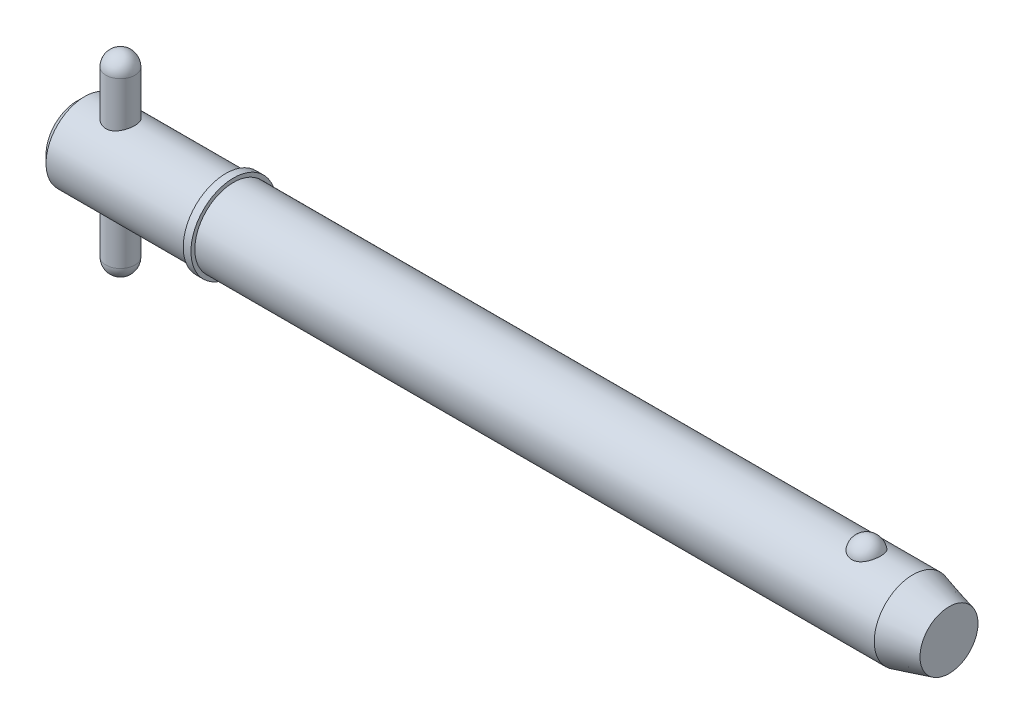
ISO-10303-21;
HEADER;
FILE_DESCRIPTION(('STEP AP214'),'2;1');
FILE_NAME('part.step','',(''),(''),'','','');
FILE_SCHEMA(('AUTOMOTIVE_DESIGN { 1 0 10303 214 1 1 1 1 }'));
ENDSEC;
DATA;
#1=APPLICATION_CONTEXT('core data for automotive mechanical design processes');
#2=APPLICATION_PROTOCOL_DEFINITION('international standard','automotive_design',2000,#1);
#3=PRODUCT_CONTEXT('',#1,'mechanical');
#4=PRODUCT('Part','Part','',(#3));
#5=PRODUCT_RELATED_PRODUCT_CATEGORY('part','',(#4));
#6=PRODUCT_DEFINITION_FORMATION('','',#4);
#7=PRODUCT_DEFINITION_CONTEXT('part definition',#1,'design');
#8=PRODUCT_DEFINITION('design','',#6,#7);
#9=PRODUCT_DEFINITION_SHAPE('','',#8);
#10=(LENGTH_UNIT() NAMED_UNIT(*) SI_UNIT(.MILLI.,.METRE.));
#11=(NAMED_UNIT(*) PLANE_ANGLE_UNIT() SI_UNIT($,.RADIAN.));
#12=(NAMED_UNIT(*) SI_UNIT($,.STERADIAN.) SOLID_ANGLE_UNIT());
#13=UNCERTAINTY_MEASURE_WITH_UNIT(LENGTH_MEASURE(1.E-05),#10,'distance_accuracy_value','');
#14=(GEOMETRIC_REPRESENTATION_CONTEXT(3) GLOBAL_UNCERTAINTY_ASSIGNED_CONTEXT((#13)) GLOBAL_UNIT_ASSIGNED_CONTEXT((#10,
#11,#12)) REPRESENTATION_CONTEXT('',''));
#15=CARTESIAN_POINT('',(0.,0.,0.));
#16=DIRECTION('',(0.,0.,1.));
#17=DIRECTION('',(1.,0.,0.));
#18=AXIS2_PLACEMENT_3D('',#15,#16,#17);
#19=CARTESIAN_POINT('',(7.14,15.875,0.));
#20=DIRECTION('',(0.,-1.,0.));
#21=DIRECTION('',(0.,0.,-1.));
#22=AXIS2_PLACEMENT_3D('',#19,#20,#21);
#23=CYLINDRICAL_SURFACE('',#22,2.38);
#24=CARTESIAN_POINT('',(7.14,-13.495,0.));
#25=DIRECTION('',(0.,-1.,0.));
#26=DIRECTION('',(0.,0.,-1.));
#27=AXIS2_PLACEMENT_3D('',#24,#25,#26);
#28=CIRCLE('',#27,2.38);
#29=CARTESIAN_POINT('',(7.14,-13.495,-2.38));
#30=VERTEX_POINT('',#29);
#31=EDGE_CURVE('P0_E10',#30,#30,#28,.F.);
#32=ORIENTED_EDGE('',*,*,#31,.T.);
#33=EDGE_LOOP('',(#32));
#34=FACE_BOUND('',#33,.T.);
#35=CARTESIAN_POINT('',(7.14,13.495,0.));
#36=DIRECTION('',(0.,-1.,0.));
#37=DIRECTION('',(0.,0.,-1.));
#38=AXIS2_PLACEMENT_3D('',#35,#36,#37);
#39=CIRCLE('',#38,2.38);
#40=CARTESIAN_POINT('',(7.14,13.495,-2.38));
#41=VERTEX_POINT('',#40);
#42=EDGE_CURVE('P0_E21',#41,#41,#39,.T.);
#43=ORIENTED_EDGE('',*,*,#42,.T.);
#44=EDGE_LOOP('',(#43));
#45=FACE_BOUND('',#44,.T.);
#46=ADVANCED_FACE('P0_F14',(#34,#45),#23,.T.);
#47=CARTESIAN_POINT('',(7.14,-13.495,0.));
#48=DIRECTION('',(0.,0.,1.));
#49=DIRECTION('',(1.,0.,0.));
#50=AXIS2_PLACEMENT_3D('',#47,#48,#49);
#51=SPHERICAL_SURFACE('',#50,2.38);
#52=CARTESIAN_POINT('',(7.14,-13.495,0.));
#53=DIRECTION('',(0.,-1.,0.));
#54=DIRECTION('',(0.,0.,-1.));
#55=AXIS2_PLACEMENT_3D('',#52,#53,#54);
#56=SPHERICAL_SURFACE('',#55,2.38);
#57=ORIENTED_EDGE('',*,*,#31,.F.);
#58=EDGE_LOOP('',(#57));
#59=FACE_BOUND('',#58,.T.);
#60=ADVANCED_FACE('P0_F29',(#59),#56,.T.);
#61=CARTESIAN_POINT('',(7.14,13.495,0.));
#62=DIRECTION('',(0.,0.,1.));
#63=DIRECTION('',(1.,0.,0.));
#64=AXIS2_PLACEMENT_3D('',#61,#62,#63);
#65=SPHERICAL_SURFACE('',#64,2.38);
#66=CARTESIAN_POINT('',(7.14,13.495,0.));
#67=DIRECTION('',(0.,-1.,0.));
#68=DIRECTION('',(0.,0.,-1.));
#69=AXIS2_PLACEMENT_3D('',#66,#67,#68);
#70=SPHERICAL_SURFACE('',#69,2.38);
#71=ORIENTED_EDGE('',*,*,#42,.F.);
#72=EDGE_LOOP('',(#71));
#73=FACE_BOUND('',#72,.T.);
#74=ADVANCED_FACE('P0_F16',(#73),#70,.T.);
#75=CLOSED_SHELL('',(#46,#60,#74));
#76=MANIFOLD_SOLID_BREP('P0_B1',#75);
#77=CARTESIAN_POINT('',(0.,0.,0.));
#78=DIRECTION('',(1.,0.,0.));
#79=DIRECTION('',(0.,0.,-1.));
#80=AXIS2_PLACEMENT_3D('',#77,#78,#79);
#81=CYLINDRICAL_SURFACE('',#80,6.35);
#82=CARTESIAN_POINT('',(137.255369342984,0.,0.));
#83=DIRECTION('',(1.,0.,0.));
#84=DIRECTION('',(0.,0.,-1.));
#85=AXIS2_PLACEMENT_3D('',#82,#83,#84);
#86=CIRCLE('',#85,6.35);
#87=CARTESIAN_POINT('',(137.255369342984,0.,-6.35));
#88=VERTEX_POINT('',#87);
#89=EDGE_CURVE('P1_E81',#88,#88,#86,.T.);
#90=ORIENTED_EDGE('',*,*,#89,.F.);
#91=EDGE_LOOP('',(#90));
#92=FACE_BOUND('',#91,.T.);
#93=CARTESIAN_POINT('',(25.7,0.,0.));
#94=DIRECTION('',(1.,0.,0.));
#95=DIRECTION('',(0.,0.,-1.));
#96=AXIS2_PLACEMENT_3D('',#93,#94,#95);
#97=CIRCLE('',#96,6.35);
#98=CARTESIAN_POINT('',(25.7,0.,-6.35));
#99=VERTEX_POINT('',#98);
#100=EDGE_CURVE('P1_E85',#99,#99,#97,.T.);
#101=ORIENTED_EDGE('',*,*,#100,.T.);
#102=EDGE_LOOP('',(#101));
#103=FACE_BOUND('',#102,.T.);
#104=CARTESIAN_POINT('',(129.630021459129,5.87502187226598,2.40969251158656));
#105=CARTESIAN_POINT('',(129.505030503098,5.87501645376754,2.40969773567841));
#106=CARTESIAN_POINT('',(129.380080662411,5.87916061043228,2.3996729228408));
#107=CARTESIAN_POINT('',(129.133909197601,5.89523112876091,2.35991730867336));
#108=CARTESIAN_POINT('',(129.012686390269,5.90715499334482,2.33019283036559));
#109=CARTESIAN_POINT('',(128.777517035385,5.9373956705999,2.25201402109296));
#110=CARTESIAN_POINT('',(128.663560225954,5.95570321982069,2.20358681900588));
#111=CARTESIAN_POINT('',(128.44557352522,5.99672067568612,2.08937987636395));
#112=CARTESIAN_POINT('',(128.341545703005,6.01943149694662,2.0235965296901));
#113=CARTESIAN_POINT('',(128.142943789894,6.06760647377,1.87428969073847));
#114=CARTESIAN_POINT('',(128.048726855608,6.0931309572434,1.79031110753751));
#115=CARTESIAN_POINT('',(127.875255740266,6.14375873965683,1.60800178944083));
#116=CARTESIAN_POINT('',(127.796004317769,6.16886196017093,1.50966841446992));
#117=CARTESIAN_POINT('',(127.650845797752,6.2172460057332,1.29645884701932));
#118=CARTESIAN_POINT('',(127.585688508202,6.24039621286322,1.18104158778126));
#119=CARTESIAN_POINT('',(127.474703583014,6.28117277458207,0.940351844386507));
#120=CARTESIAN_POINT('',(127.428877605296,6.29879865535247,0.815078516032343));
#121=CARTESIAN_POINT('',(127.357023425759,6.32692073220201,0.556494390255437));
#122=CARTESIAN_POINT('',(127.331249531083,6.33732517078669,0.423102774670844));
#123=CARTESIAN_POINT('',(127.300988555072,6.34957673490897,0.15354272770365));
#124=CARTESIAN_POINT('',(127.296500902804,6.35142408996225,0.0173743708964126));
#125=CARTESIAN_POINT('',(127.308865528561,6.34638925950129,-0.253036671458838));
#126=CARTESIAN_POINT('',(127.325594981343,6.33955731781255,-0.38728593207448));
#127=CARTESIAN_POINT('',(127.379843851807,6.31794129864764,-0.650851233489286));
#128=CARTESIAN_POINT('',(127.417363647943,6.30315707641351,-0.780167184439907));
#129=CARTESIAN_POINT('',(127.512500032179,6.26711642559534,-1.03041949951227));
#130=CARTESIAN_POINT('',(127.570143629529,6.24585130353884,-1.1513443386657));
#131=CARTESIAN_POINT('',(127.704352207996,6.19905619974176,-1.38129800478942));
#132=CARTESIAN_POINT('',(127.780918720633,6.17352587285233,-1.49032586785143));
#133=CARTESIAN_POINT('',(127.951753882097,6.12080227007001,-1.69393164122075));
#134=CARTESIAN_POINT('',(128.046100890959,6.09360200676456,-1.78844209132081));
#135=CARTESIAN_POINT('',(128.250119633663,6.0407043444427,-1.95970536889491));
#136=CARTESIAN_POINT('',(128.359790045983,6.01500681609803,-2.03645972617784));
#137=CARTESIAN_POINT('',(128.589187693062,5.96867714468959,-2.16845644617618));
#138=CARTESIAN_POINT('',(128.708652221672,5.94794910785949,-2.22412062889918));
#139=CARTESIAN_POINT('',(128.956218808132,5.91340580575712,-2.31440992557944));
#140=CARTESIAN_POINT('',(129.084317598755,5.8995879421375,-2.34904294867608));
#141=CARTESIAN_POINT('',(129.338582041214,5.88111049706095,-2.39491590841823));
#142=CARTESIAN_POINT('',(129.464520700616,5.876025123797,-2.40724512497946));
#143=CARTESIAN_POINT('',(129.716786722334,5.87428980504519,-2.41147867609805));
#144=CARTESIAN_POINT('',(129.843114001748,5.87763817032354,-2.4033871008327));
#145=CARTESIAN_POINT('',(130.088417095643,5.89212921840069,-2.36762715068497));
#146=CARTESIAN_POINT('',(130.207499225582,5.90302431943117,-2.34058030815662));
#147=CARTESIAN_POINT('',(130.43924472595,5.93113752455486,-2.26839066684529));
#148=CARTESIAN_POINT('',(130.551907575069,5.94835614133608,-2.22324640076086));
#149=CARTESIAN_POINT('',(130.770400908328,5.98773016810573,-2.1149380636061));
#150=CARTESIAN_POINT('',(130.876028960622,6.00998499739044,-2.05140269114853));
#151=CARTESIAN_POINT('',(131.075300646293,6.0569014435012,-1.9084270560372));
#152=CARTESIAN_POINT('',(131.168941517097,6.08156361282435,-1.82898313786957));
#153=CARTESIAN_POINT('',(131.346675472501,6.13211715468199,-1.65182429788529));
#154=CARTESIAN_POINT('',(131.430055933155,6.15800825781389,-1.55339381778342));
#155=CARTESIAN_POINT('',(131.579790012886,6.2071283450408,-1.34374214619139));
#156=CARTESIAN_POINT('',(131.646140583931,6.23035685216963,-1.23251867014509));
#157=CARTESIAN_POINT('',(131.762345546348,6.27251177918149,-0.99644720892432));
#158=CARTESIAN_POINT('',(131.811607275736,6.29127762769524,-0.871278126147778));
#159=CARTESIAN_POINT('',(131.889614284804,6.3215862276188,-0.613870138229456));
#160=CARTESIAN_POINT('',(131.918359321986,6.33312889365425,-0.481631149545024));
#161=CARTESIAN_POINT('',(131.95477058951,6.34782349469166,-0.213672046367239));
#162=CARTESIAN_POINT('',(131.962413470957,6.35096613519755,-0.0779482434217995));
#163=CARTESIAN_POINT('',(131.956395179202,6.34851322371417,0.192943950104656));
#164=CARTESIAN_POINT('',(131.942734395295,6.3429178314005,0.328112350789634));
#165=CARTESIAN_POINT('',(131.89450361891,6.32360512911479,0.593406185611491));
#166=CARTESIAN_POINT('',(131.860031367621,6.30992579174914,0.723552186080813));
#167=CARTESIAN_POINT('',(131.770953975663,6.27586325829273,0.975834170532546));
#168=CARTESIAN_POINT('',(131.71634761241,6.25547965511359,1.09796966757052));
#169=CARTESIAN_POINT('',(131.58775879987,6.20998183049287,1.33148921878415));
#170=CARTESIAN_POINT('',(131.513674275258,6.18484288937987,1.44281227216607));
#171=CARTESIAN_POINT('',(131.347820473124,6.13258735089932,1.65087683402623));
#172=CARTESIAN_POINT('',(131.256051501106,6.10547078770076,1.74761859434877));
#173=CARTESIAN_POINT('',(131.057183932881,6.05235879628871,1.92350926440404));
#174=CARTESIAN_POINT('',(130.950133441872,6.02636017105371,2.00271146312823));
#175=CARTESIAN_POINT('',(130.723138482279,5.97843747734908,2.14154159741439));
#176=CARTESIAN_POINT('',(130.603191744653,5.95651412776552,2.2011660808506));
#177=CARTESIAN_POINT('',(130.344523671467,5.91812106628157,2.30250570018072));
#178=CARTESIAN_POINT('',(130.20506980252,5.90217533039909,2.34256795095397));
#179=CARTESIAN_POINT('',(129.920397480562,5.88063128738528,2.39615214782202));
#180=CARTESIAN_POINT('',(129.77518174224,5.87502816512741,2.40968644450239));
#181=CARTESIAN_POINT('',(129.630021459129,5.87502187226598,2.40969251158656));
#182=B_SPLINE_CURVE_WITH_KNOTS('',3,(#104,#105,#106,#107,#108,#109,#110,#111,#112,#113,#114,
#115,#116,#117,#118,#119,#120,#121,#122,#123,#124,#125,#126,#127,#128,#129,#130,#131,#132,#133,
#134,#135,#136,#137,#138,#139,#140,#141,#142,#143,#144,#145,#146,#147,#148,#149,#150,#151,#152,
#153,#154,#155,#156,#157,#158,#159,#160,#161,#162,#163,#164,#165,#166,#167,#168,#169,#170,#171,
#172,#173,#174,#175,#176,#177,#178,#179,#180,#181),.UNSPECIFIED.,.T.,.F.,(4,2,2,2,2,2,2,2,2,2,2,
2,2,2,2,2,2,2,2,2,2,2,2,2,2,2,2,2,2,2,2,2,2,2,2,2,2,2,4),(0.,0.374440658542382,
0.748761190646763,1.12254078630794,1.49639810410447,1.88098871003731,2.2656501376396,
2.66741104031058,3.06920639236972,3.47601794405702,3.88281858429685,4.28727498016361,
4.69173873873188,5.09674745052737,5.50178895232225,5.90865911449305,6.31549420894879,
6.71369855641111,7.11175305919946,7.48978077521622,7.8677327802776,8.23383886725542,
8.5999746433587,8.97409044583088,9.34829231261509,9.74122667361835,10.1342313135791,
10.539752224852,10.945277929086,11.3512521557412,11.7572189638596,12.1612938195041,
12.5653932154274,12.9716540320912,13.37790783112,13.782909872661,14.1879832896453,
14.6230486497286,15.0579114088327),.UNSPECIFIED.);
#183=CARTESIAN_POINT('',(129.630021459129,5.87502187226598,2.40969251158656));
#184=VERTEX_POINT('',#183);
#185=EDGE_CURVE('P1_E35',#184,#184,#182,.T.);
#186=ORIENTED_EDGE('',*,*,#185,.T.);
#187=EDGE_LOOP('',(#186));
#188=FACE_BOUND('',#187,.T.);
#189=ADVANCED_FACE('P1_F13',(#92,#103,#188),#81,.T.);
#190=CARTESIAN_POINT('',(0.,0.,0.));
#191=DIRECTION('',(-1.,0.,0.));
#192=DIRECTION('',(0.,0.,1.));
#193=AXIS2_PLACEMENT_3D('',#190,#191,#192);
#194=PLANE('',#193);
#195=CARTESIAN_POINT('',(0.,0.,0.));
#196=DIRECTION('',(1.,0.,0.));
#197=DIRECTION('',(0.,0.,-1.));
#198=AXIS2_PLACEMENT_3D('',#195,#196,#197);
#199=CIRCLE('',#198,5.08);
#200=CARTESIAN_POINT('',(0.,0.,-5.08));
#201=VERTEX_POINT('',#200);
#202=EDGE_CURVE('P1_E9',#201,#201,#199,.T.);
#203=ORIENTED_EDGE('',*,*,#202,.F.);
#204=EDGE_LOOP('',(#203));
#205=FACE_BOUND('',#204,.T.);
#206=ADVANCED_FACE('P1_F15',(#205),#194,.T.);
#207=CARTESIAN_POINT('',(1.27,0.,0.));
#208=DIRECTION('',(1.,0.,0.));
#209=DIRECTION('',(0.,0.,-1.));
#210=AXIS2_PLACEMENT_3D('',#207,#208,#209);
#211=CONICAL_SURFACE('',#210,6.35,0.78539816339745);
#212=ORIENTED_EDGE('',*,*,#202,.T.);
#213=EDGE_LOOP('',(#212));
#214=FACE_BOUND('',#213,.T.);
#215=CARTESIAN_POINT('',(1.27,0.,0.));
#216=DIRECTION('',(1.,0.,0.));
#217=DIRECTION('',(0.,0.,-1.));
#218=AXIS2_PLACEMENT_3D('',#215,#216,#217);
#219=CIRCLE('',#218,6.35);
#220=CARTESIAN_POINT('',(1.27,0.,-6.35));
#221=VERTEX_POINT('',#220);
#222=EDGE_CURVE('P1_E26',#221,#221,#219,.T.);
#223=ORIENTED_EDGE('',*,*,#222,.F.);
#224=EDGE_LOOP('',(#223));
#225=FACE_BOUND('',#224,.T.);
#226=ADVANCED_FACE('P1_F77',(#214,#225),#211,.T.);
#227=CARTESIAN_POINT('',(0.,0.,0.));
#228=DIRECTION('',(1.,0.,0.));
#229=DIRECTION('',(0.,0.,-1.));
#230=AXIS2_PLACEMENT_3D('',#227,#228,#229);
#231=CYLINDRICAL_SURFACE('',#230,6.35);
#232=CARTESIAN_POINT('',(7.14,-5.88711304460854,2.38));
#233=CARTESIAN_POINT('',(7.01146258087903,-5.88710856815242,2.38000480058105));
#234=CARTESIAN_POINT('',(6.88295682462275,-5.89136840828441,2.36955244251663));
#235=CARTESIAN_POINT('',(6.62981934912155,-5.90782785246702,2.32820953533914));
#236=CARTESIAN_POINT('',(6.50518751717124,-5.92002722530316,2.29731958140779));
#237=CARTESIAN_POINT('',(6.26352403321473,-5.95079384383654,2.21639366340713));
#238=CARTESIAN_POINT('',(6.14647496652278,-5.96934583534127,2.16640353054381));
#239=CARTESIAN_POINT('',(5.92237941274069,-6.01070278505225,2.04885862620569));
#240=CARTESIAN_POINT('',(5.81533593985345,-6.03350901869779,1.98129858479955));
#241=CARTESIAN_POINT('',(5.60897525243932,-6.08207341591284,1.82693902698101));
#242=CARTESIAN_POINT('',(5.51022503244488,-6.10791836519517,1.73940861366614));
#243=CARTESIAN_POINT('',(5.32840561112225,-6.15892405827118,1.54914379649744));
#244=CARTESIAN_POINT('',(5.24533975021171,-6.1840846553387,1.44640616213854));
#245=CARTESIAN_POINT('',(5.09451639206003,-6.23191821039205,1.22434014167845));
#246=CARTESIAN_POINT('',(5.02737511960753,-6.25447755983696,1.10456656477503));
#247=CARTESIAN_POINT('',(4.91443001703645,-6.2935236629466,0.854429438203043));
#248=CARTESIAN_POINT('',(4.86861879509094,-6.31001251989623,0.724069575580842));
#249=CARTESIAN_POINT('',(4.80162253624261,-6.33444370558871,0.46242122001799));
#250=CARTESIAN_POINT('',(4.77946137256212,-6.34272370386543,0.331414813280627));
#251=CARTESIAN_POINT('',(4.75726677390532,-6.35101600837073,0.0672982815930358));
#252=CARTESIAN_POINT('',(4.75722615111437,-6.35103100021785,-0.0658111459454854));
#253=CARTESIAN_POINT('',(4.77870510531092,-6.3430064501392,-0.323358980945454));
#254=CARTESIAN_POINT('',(4.79915922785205,-6.33536494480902,-0.447900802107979));
#255=CARTESIAN_POINT('',(4.85925493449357,-6.31340794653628,-0.69163609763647));
#256=CARTESIAN_POINT('',(4.89889787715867,-6.29909198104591,-0.810829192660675));
#257=CARTESIAN_POINT('',(4.9967414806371,-6.26494471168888,-1.04254212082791));
#258=CARTESIAN_POINT('',(5.05520370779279,-6.24503620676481,-1.1549396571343));
#259=CARTESIAN_POINT('',(5.1887948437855,-6.20171869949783,-1.3686079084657));
#260=CARTESIAN_POINT('',(5.26392912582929,-6.17830856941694,-1.46987502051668));
#261=CARTESIAN_POINT('',(5.43386591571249,-6.12878580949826,-1.66468415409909));
#262=CARTESIAN_POINT('',(5.52956139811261,-6.10259519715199,-1.75742857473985));
#263=CARTESIAN_POINT('',(5.73530435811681,-6.05155777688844,-1.92585331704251));
#264=CARTESIAN_POINT('',(5.84535542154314,-6.02671130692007,-2.00152936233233));
#265=CARTESIAN_POINT('',(6.07982989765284,-5.98068420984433,-2.13519109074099));
#266=CARTESIAN_POINT('',(6.20451768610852,-5.95959698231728,-2.19274775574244));
#267=CARTESIAN_POINT('',(6.4628145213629,-5.92455622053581,-2.28574558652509));
#268=CARTESIAN_POINT('',(6.59641856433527,-5.91059872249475,-2.32119904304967));
#269=CARTESIAN_POINT('',(6.86087441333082,-5.8923327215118,-2.36717069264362));
#270=CARTESIAN_POINT('',(6.99147192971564,-5.8875347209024,-2.37895573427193));
#271=CARTESIAN_POINT('',(7.25283805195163,-5.88674545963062,-2.38091046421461));
#272=CARTESIAN_POINT('',(7.38360660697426,-5.89075200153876,-2.37108554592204));
#273=CARTESIAN_POINT('',(7.63510696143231,-5.90662331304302,-2.33124781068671));
#274=CARTESIAN_POINT('',(7.75602069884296,-5.91810660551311,-2.30221396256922));
#275=CARTESIAN_POINT('',(7.99120505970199,-5.94718527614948,-2.22601401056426));
#276=CARTESIAN_POINT('',(8.10547431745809,-5.96478190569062,-2.17884419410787));
#277=CARTESIAN_POINT('',(8.32888632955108,-6.00491533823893,-2.06572311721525));
#278=CARTESIAN_POINT('',(8.43767672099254,-6.02761250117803,-1.99913452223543));
#279=CARTESIAN_POINT('',(8.6429894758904,-6.07511988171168,-1.84974438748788));
#280=CARTESIAN_POINT('',(8.73950733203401,-6.09993087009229,-1.76693691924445));
#281=CARTESIAN_POINT('',(8.9238741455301,-6.1507686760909,-1.58125563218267));
#282=CARTESIAN_POINT('',(9.01078732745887,-6.17677301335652,-1.47744327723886));
#283=CARTESIAN_POINT('',(9.16607127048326,-6.22556172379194,-1.25606967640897));
#284=CARTESIAN_POINT('',(9.23444197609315,-6.24834608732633,-1.13850838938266));
#285=CARTESIAN_POINT('',(9.3502493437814,-6.28811144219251,-0.893050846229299));
#286=CARTESIAN_POINT('',(9.39775808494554,-6.30511236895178,-0.765192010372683));
#287=CARTESIAN_POINT('',(9.47032640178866,-6.33145833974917,-0.502514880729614));
#288=CARTESIAN_POINT('',(9.49539651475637,-6.34080697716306,-0.367699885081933));
#289=CARTESIAN_POINT('',(9.52124059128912,-6.35045496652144,-0.103396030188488));
#290=CARTESIAN_POINT('',(9.52334421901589,-6.35124952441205,0.025945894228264));
#291=CARTESIAN_POINT('',(9.50661518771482,-6.34499064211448,0.283061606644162));
#292=CARTESIAN_POINT('',(9.48778504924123,-6.33793814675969,0.410835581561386));
#293=CARTESIAN_POINT('',(9.43065630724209,-6.31700307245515,0.658028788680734));
#294=CARTESIAN_POINT('',(9.39284291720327,-6.30329098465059,0.7775756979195));
#295=CARTESIAN_POINT('',(9.29930406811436,-6.27046903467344,1.00863789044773));
#296=CARTESIAN_POINT('',(9.2435752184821,-6.25135815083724,1.12015164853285));
#297=CARTESIAN_POINT('',(9.11312349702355,-6.20865254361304,1.33711407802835));
#298=CARTESIAN_POINT('',(9.03770094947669,-6.18490316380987,1.44211105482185));
#299=CARTESIAN_POINT('',(8.87110640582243,-6.13583718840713,1.63836897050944));
#300=CARTESIAN_POINT('',(8.77992879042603,-6.11052003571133,1.72962498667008));
#301=CARTESIAN_POINT('',(8.57869799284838,-6.05953829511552,1.90076098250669));
#302=CARTESIAN_POINT('',(8.46790320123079,-6.03392573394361,1.97978778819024));
#303=CARTESIAN_POINT('',(8.23379693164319,-5.98676607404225,2.11813466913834));
#304=CARTESIAN_POINT('',(8.11048418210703,-5.9652193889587,2.17745273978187));
#305=CARTESIAN_POINT('',(7.84900037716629,-5.92818393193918,2.27641807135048));
#306=CARTESIAN_POINT('',(7.71041678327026,-5.91299857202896,2.31510015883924));
#307=CARTESIAN_POINT('',(7.42787316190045,-5.89246887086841,2.36688002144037));
#308=CARTESIAN_POINT('',(7.28391673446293,-5.88711805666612,2.37999462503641));
#309=CARTESIAN_POINT('',(7.14,-5.88711304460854,2.38));
#310=B_SPLINE_CURVE_WITH_KNOTS('',3,(#232,#233,#234,#235,#236,#237,#238,#239,#240,#241,#242,
#243,#244,#245,#246,#247,#248,#249,#250,#251,#252,#253,#254,#255,#256,#257,#258,#259,#260,#261,
#262,#263,#264,#265,#266,#267,#268,#269,#270,#271,#272,#273,#274,#275,#276,#277,#278,#279,#280,
#281,#282,#283,#284,#285,#286,#287,#288,#289,#290,#291,#292,#293,#294,#295,#296,#297,#298,#299,
#300,#301,#302,#303,#304,#305,#306,#307,#308,#309),.UNSPECIFIED.,.T.,.F.,(4,2,2,2,2,2,2,2,2,2,2,
2,2,2,2,2,2,2,2,2,2,2,2,2,2,2,2,2,2,2,2,2,2,2,2,2,2,2,4),(0.,0.385076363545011,
0.770141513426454,1.15428843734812,1.53855071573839,1.94016118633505,2.3418570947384,
2.75720522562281,3.1724093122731,3.569721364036,3.96690431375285,4.34445758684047,
4.72203759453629,5.10511017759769,5.48830640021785,5.89390240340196,6.29959991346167,
6.71428455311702,7.12873839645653,7.52034494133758,7.91185376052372,8.28480528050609,
8.65783318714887,9.0448340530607,9.43197664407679,9.84363087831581,10.2552863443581,
10.6655081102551,11.0755371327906,11.4616919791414,11.847800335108,12.224507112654,
12.6012852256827,12.9938941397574,13.386643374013,13.8000944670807,14.2135876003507,
14.6450218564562,15.0761720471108),.UNSPECIFIED.);
#311=CARTESIAN_POINT('',(7.14,-5.88711304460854,2.38));
#312=VERTEX_POINT('',#311);
#313=EDGE_CURVE('P1_E17',#312,#312,#310,.T.);
#314=ORIENTED_EDGE('',*,*,#313,.F.);
#315=EDGE_LOOP('',(#314));
#316=FACE_BOUND('',#315,.T.);
#317=CARTESIAN_POINT('',(7.14,5.88711304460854,2.38));
#318=CARTESIAN_POINT('',(7.26853741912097,5.88710856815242,2.38000480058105));
#319=CARTESIAN_POINT('',(7.39704317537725,5.89136840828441,2.36955244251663));
#320=CARTESIAN_POINT('',(7.65018065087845,5.90782785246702,2.32820953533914));
#321=CARTESIAN_POINT('',(7.77481248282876,5.92002722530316,2.29731958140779));
#322=CARTESIAN_POINT('',(8.01647596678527,5.95079384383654,2.21639366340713));
#323=CARTESIAN_POINT('',(8.13352503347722,5.96934583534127,2.16640353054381));
#324=CARTESIAN_POINT('',(8.35762058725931,6.01070278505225,2.04885862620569));
#325=CARTESIAN_POINT('',(8.46466406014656,6.03350901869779,1.98129858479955));
#326=CARTESIAN_POINT('',(8.67102474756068,6.08207341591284,1.82693902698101));
#327=CARTESIAN_POINT('',(8.76977496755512,6.10791836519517,1.73940861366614));
#328=CARTESIAN_POINT('',(8.95159438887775,6.15892405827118,1.54914379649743));
#329=CARTESIAN_POINT('',(9.03466024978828,6.1840846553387,1.44640616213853));
#330=CARTESIAN_POINT('',(9.18548360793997,6.23191821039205,1.22434014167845));
#331=CARTESIAN_POINT('',(9.25262488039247,6.25447755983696,1.10456656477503));
#332=CARTESIAN_POINT('',(9.36556998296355,6.2935236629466,0.854429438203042));
#333=CARTESIAN_POINT('',(9.41138120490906,6.31001251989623,0.72406957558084));
#334=CARTESIAN_POINT('',(9.47837746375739,6.33444370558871,0.462421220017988));
#335=CARTESIAN_POINT('',(9.50053862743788,6.34272370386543,0.331414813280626));
#336=CARTESIAN_POINT('',(9.52273322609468,6.35101600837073,0.0672982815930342));
#337=CARTESIAN_POINT('',(9.52277384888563,6.35103100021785,-0.0658111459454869));
#338=CARTESIAN_POINT('',(9.50129489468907,6.3430064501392,-0.323358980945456));
#339=CARTESIAN_POINT('',(9.48084077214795,6.33536494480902,-0.447900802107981));
#340=CARTESIAN_POINT('',(9.42074506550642,6.31340794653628,-0.691636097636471));
#341=CARTESIAN_POINT('',(9.38110212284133,6.29909198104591,-0.810829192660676));
#342=CARTESIAN_POINT('',(9.2832585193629,6.26494471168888,-1.04254212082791));
#343=CARTESIAN_POINT('',(9.22479629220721,6.24503620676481,-1.1549396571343));
#344=CARTESIAN_POINT('',(9.0912051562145,6.20171869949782,-1.3686079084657));
#345=CARTESIAN_POINT('',(9.0160708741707,6.17830856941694,-1.46987502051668));
#346=CARTESIAN_POINT('',(8.84613408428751,6.12878580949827,-1.66468415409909));
#347=CARTESIAN_POINT('',(8.75043860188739,6.10259519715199,-1.75742857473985));
#348=CARTESIAN_POINT('',(8.54469564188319,6.05155777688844,-1.92585331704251));
#349=CARTESIAN_POINT('',(8.43464457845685,6.02671130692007,-2.00152936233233));
#350=CARTESIAN_POINT('',(8.20017010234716,5.98068420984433,-2.13519109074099));
#351=CARTESIAN_POINT('',(8.07548231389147,5.95959698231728,-2.19274775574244));
#352=CARTESIAN_POINT('',(7.8171854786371,5.9245562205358,-2.28574558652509));
#353=CARTESIAN_POINT('',(7.68358143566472,5.91059872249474,-2.32119904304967));
#354=CARTESIAN_POINT('',(7.41912558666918,5.8923327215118,-2.36717069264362));
#355=CARTESIAN_POINT('',(7.28852807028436,5.8875347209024,-2.37895573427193));
#356=CARTESIAN_POINT('',(7.02716194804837,5.88674545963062,-2.38091046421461));
#357=CARTESIAN_POINT('',(6.89639339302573,5.89075200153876,-2.37108554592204));
#358=CARTESIAN_POINT('',(6.64489303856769,5.90662331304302,-2.33124781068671));
#359=CARTESIAN_POINT('',(6.52397930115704,5.91810660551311,-2.30221396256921));
#360=CARTESIAN_POINT('',(6.288794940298,5.94718527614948,-2.22601401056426));
#361=CARTESIAN_POINT('',(6.17452568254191,5.96478190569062,-2.17884419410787));
#362=CARTESIAN_POINT('',(5.95111367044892,6.00491533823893,-2.06572311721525));
#363=CARTESIAN_POINT('',(5.84232327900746,6.02761250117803,-1.99913452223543));
#364=CARTESIAN_POINT('',(5.6370105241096,6.07511988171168,-1.84974438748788));
#365=CARTESIAN_POINT('',(5.54049266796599,6.09993087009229,-1.76693691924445));
#366=CARTESIAN_POINT('',(5.3561258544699,6.1507686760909,-1.58125563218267));
#367=CARTESIAN_POINT('',(5.26921267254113,6.17677301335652,-1.47744327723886));
#368=CARTESIAN_POINT('',(5.11392872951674,6.22556172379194,-1.25606967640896));
#369=CARTESIAN_POINT('',(5.04555802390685,6.24834608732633,-1.13850838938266));
#370=CARTESIAN_POINT('',(4.9297506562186,6.28811144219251,-0.893050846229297));
#371=CARTESIAN_POINT('',(4.88224191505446,6.30511236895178,-0.76519201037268));
#372=CARTESIAN_POINT('',(4.80967359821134,6.33145833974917,-0.502514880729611));
#373=CARTESIAN_POINT('',(4.78460348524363,6.34080697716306,-0.36769988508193));
#374=CARTESIAN_POINT('',(4.75875940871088,6.35045496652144,-0.103396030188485));
#375=CARTESIAN_POINT('',(4.75665578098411,6.35124952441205,0.025945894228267));
#376=CARTESIAN_POINT('',(4.77338481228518,6.34499064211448,0.283061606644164));
#377=CARTESIAN_POINT('',(4.79221495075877,6.33793814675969,0.410835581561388));
#378=CARTESIAN_POINT('',(4.84934369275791,6.31700307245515,0.658028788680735));
#379=CARTESIAN_POINT('',(4.88715708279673,6.30329098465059,0.777575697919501));
#380=CARTESIAN_POINT('',(4.98069593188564,6.27046903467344,1.00863789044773));
#381=CARTESIAN_POINT('',(5.0364247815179,6.25135815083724,1.12015164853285));
#382=CARTESIAN_POINT('',(5.16687650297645,6.20865254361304,1.33711407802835));
#383=CARTESIAN_POINT('',(5.24229905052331,6.18490316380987,1.44211105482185));
#384=CARTESIAN_POINT('',(5.40889359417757,6.13583718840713,1.63836897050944));
#385=CARTESIAN_POINT('',(5.50007120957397,6.11052003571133,1.72962498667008));
#386=CARTESIAN_POINT('',(5.70130200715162,6.05953829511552,1.90076098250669));
#387=CARTESIAN_POINT('',(5.81209679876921,6.03392573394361,1.97978778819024));
#388=CARTESIAN_POINT('',(6.04620306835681,5.98676607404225,2.11813466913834));
#389=CARTESIAN_POINT('',(6.16951581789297,5.9652193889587,2.17745273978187));
#390=CARTESIAN_POINT('',(6.43099962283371,5.92818393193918,2.27641807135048));
#391=CARTESIAN_POINT('',(6.56958321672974,5.91299857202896,2.31510015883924));
#392=CARTESIAN_POINT('',(6.85212683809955,5.89246887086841,2.36688002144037));
#393=CARTESIAN_POINT('',(6.99608326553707,5.88711805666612,2.37999462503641));
#394=CARTESIAN_POINT('',(7.14,5.88711304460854,2.38));
#395=B_SPLINE_CURVE_WITH_KNOTS('',3,(#317,#318,#319,#320,#321,#322,#323,#324,#325,#326,#327,
#328,#329,#330,#331,#332,#333,#334,#335,#336,#337,#338,#339,#340,#341,#342,#343,#344,#345,#346,
#347,#348,#349,#350,#351,#352,#353,#354,#355,#356,#357,#358,#359,#360,#361,#362,#363,#364,#365,
#366,#367,#368,#369,#370,#371,#372,#373,#374,#375,#376,#377,#378,#379,#380,#381,#382,#383,#384,
#385,#386,#387,#388,#389,#390,#391,#392,#393,#394),.UNSPECIFIED.,.T.,.F.,(4,2,2,2,2,2,2,2,2,2,2,
2,2,2,2,2,2,2,2,2,2,2,2,2,2,2,2,2,2,2,2,2,2,2,2,2,2,2,4),(0.,0.385076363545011,
0.770141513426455,1.15428843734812,1.53855071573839,1.94016118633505,2.3418570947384,
2.75720522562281,3.1724093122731,3.56972136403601,3.96690431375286,4.34445758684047,
4.72203759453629,5.10511017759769,5.48830640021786,5.89390240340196,6.29959991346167,
6.71428455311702,7.12873839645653,7.52034494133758,7.91185376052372,8.2848052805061,
8.65783318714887,9.0448340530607,9.43197664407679,9.84363087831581,10.2552863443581,
10.6655081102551,11.0755371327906,11.4616919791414,11.847800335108,12.2245071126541,
12.6012852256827,12.9938941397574,13.386643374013,13.8000944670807,14.2135876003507,
14.6450218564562,15.0761720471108),.UNSPECIFIED.);
#396=CARTESIAN_POINT('',(7.14,5.88711304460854,2.38));
#397=VERTEX_POINT('',#396);
#398=EDGE_CURVE('P1_E43',#397,#397,#395,.T.);
#399=ORIENTED_EDGE('',*,*,#398,.F.);
#400=EDGE_LOOP('',(#399));
#401=FACE_BOUND('',#400,.T.);
#402=ORIENTED_EDGE('',*,*,#222,.T.);
#403=EDGE_LOOP('',(#402));
#404=FACE_BOUND('',#403,.T.);
#405=CARTESIAN_POINT('',(24.43,0.,0.));
#406=DIRECTION('',(1.,0.,0.));
#407=DIRECTION('',(0.,0.,-1.));
#408=AXIS2_PLACEMENT_3D('',#405,#406,#407);
#409=CIRCLE('',#408,6.35);
#410=CARTESIAN_POINT('',(24.43,0.,-6.35));
#411=VERTEX_POINT('',#410);
#412=EDGE_CURVE('P1_E31',#411,#411,#409,.T.);
#413=ORIENTED_EDGE('',*,*,#412,.F.);
#414=EDGE_LOOP('',(#413));
#415=FACE_BOUND('',#414,.T.);
#416=ADVANCED_FACE('P1_F103',(#316,#401,#404,#415),#231,.T.);
#417=CARTESIAN_POINT('',(24.43,6.35,0.));
#418=DIRECTION('',(-1.,0.,0.));
#419=DIRECTION('',(0.,0.,1.));
#420=AXIS2_PLACEMENT_3D('',#417,#418,#419);
#421=PLANE('',#420);
#422=ORIENTED_EDGE('',*,*,#412,.T.);
#423=EDGE_LOOP('',(#422));
#424=FACE_BOUND('',#423,.T.);
#425=CARTESIAN_POINT('',(24.43,0.,0.));
#426=DIRECTION('',(1.,0.,0.));
#427=DIRECTION('',(0.,0.,-1.));
#428=AXIS2_PLACEMENT_3D('',#425,#426,#427);
#429=CIRCLE('',#428,6.985);
#430=CARTESIAN_POINT('',(24.43,0.,-6.985));
#431=VERTEX_POINT('',#430);
#432=EDGE_CURVE('P1_E91',#431,#431,#429,.T.);
#433=ORIENTED_EDGE('',*,*,#432,.F.);
#434=EDGE_LOOP('',(#433));
#435=FACE_BOUND('',#434,.T.);
#436=ADVANCED_FACE('P1_F100',(#424,#435),#421,.T.);
#437=CARTESIAN_POINT('',(0.,0.,0.));
#438=DIRECTION('',(1.,0.,0.));
#439=DIRECTION('',(0.,0.,-1.));
#440=AXIS2_PLACEMENT_3D('',#437,#438,#439);
#441=CYLINDRICAL_SURFACE('',#440,6.985);
#442=ORIENTED_EDGE('',*,*,#432,.T.);
#443=EDGE_LOOP('',(#442));
#444=FACE_BOUND('',#443,.T.);
#445=CARTESIAN_POINT('',(25.7,0.,0.));
#446=DIRECTION('',(1.,0.,0.));
#447=DIRECTION('',(0.,0.,-1.));
#448=AXIS2_PLACEMENT_3D('',#445,#446,#447);
#449=CIRCLE('',#448,6.985);
#450=CARTESIAN_POINT('',(25.7,0.,-6.985));
#451=VERTEX_POINT('',#450);
#452=EDGE_CURVE('P1_E88',#451,#451,#449,.T.);
#453=ORIENTED_EDGE('',*,*,#452,.F.);
#454=EDGE_LOOP('',(#453));
#455=FACE_BOUND('',#454,.T.);
#456=ADVANCED_FACE('P1_F68',(#444,#455),#441,.T.);
#457=CARTESIAN_POINT('',(25.7,6.985,0.));
#458=DIRECTION('',(1.,0.,0.));
#459=DIRECTION('',(0.,0.,-1.));
#460=AXIS2_PLACEMENT_3D('',#457,#458,#459);
#461=PLANE('',#460);
#462=ORIENTED_EDGE('',*,*,#452,.T.);
#463=EDGE_LOOP('',(#462));
#464=FACE_BOUND('',#463,.T.);
#465=ORIENTED_EDGE('',*,*,#100,.F.);
#466=EDGE_LOOP('',(#465));
#467=FACE_BOUND('',#466,.T.);
#468=ADVANCED_FACE('P1_F62',(#464,#467),#461,.T.);
#469=CARTESIAN_POINT('',(143.18,0.,0.));
#470=DIRECTION('',(-1.,0.,0.));
#471=DIRECTION('',(0.,0.,1.));
#472=AXIS2_PLACEMENT_3D('',#469,#470,#471);
#473=CONICAL_SURFACE('',#472,4.76250000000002,0.261799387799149);
#474=ORIENTED_EDGE('',*,*,#89,.T.);
#475=EDGE_LOOP('',(#474));
#476=FACE_BOUND('',#475,.T.);
#477=CARTESIAN_POINT('',(143.18,0.,0.));
#478=DIRECTION('',(1.,0.,0.));
#479=DIRECTION('',(0.,0.,-1.));
#480=AXIS2_PLACEMENT_3D('',#477,#478,#479);
#481=CIRCLE('',#480,4.76250000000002);
#482=CARTESIAN_POINT('',(143.18,0.,-4.76250000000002));
#483=VERTEX_POINT('',#482);
#484=EDGE_CURVE('P1_E42',#483,#483,#481,.T.);
#485=ORIENTED_EDGE('',*,*,#484,.F.);
#486=EDGE_LOOP('',(#485));
#487=FACE_BOUND('',#486,.T.);
#488=ADVANCED_FACE('P1_F59',(#476,#487),#473,.T.);
#489=CARTESIAN_POINT('',(143.18,4.76250000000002,0.));
#490=DIRECTION('',(1.,0.,0.));
#491=DIRECTION('',(0.,0.,-1.));
#492=AXIS2_PLACEMENT_3D('',#489,#490,#491);
#493=PLANE('',#492);
#494=ORIENTED_EDGE('',*,*,#484,.T.);
#495=EDGE_LOOP('',(#494));
#496=FACE_BOUND('',#495,.T.);
#497=ADVANCED_FACE('P1_F55',(#496),#493,.T.);
#498=CARTESIAN_POINT('',(129.630021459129,5.715,0.));
#499=DIRECTION('',(-1.,0.,0.));
#500=DIRECTION('',(0.,1.,0.));
#501=AXIS2_PLACEMENT_3D('',#498,#499,#500);
#502=SPHERICAL_SURFACE('',#501,2.41499999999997);
#503=ORIENTED_EDGE('',*,*,#185,.F.);
#504=EDGE_LOOP('',(#503));
#505=FACE_BOUND('',#504,.T.);
#506=ADVANCED_FACE('P1_F50',(#505),#502,.T.);
#507=CARTESIAN_POINT('',(7.14,-6.985,0.));
#508=DIRECTION('',(0.,1.,0.));
#509=DIRECTION('',(0.,0.,1.));
#510=AXIS2_PLACEMENT_3D('',#507,#508,#509);
#511=CYLINDRICAL_SURFACE('',#510,2.38);
#512=ORIENTED_EDGE('',*,*,#313,.T.);
#513=EDGE_LOOP('',(#512));
#514=FACE_BOUND('',#513,.T.);
#515=ORIENTED_EDGE('',*,*,#398,.T.);
#516=EDGE_LOOP('',(#515));
#517=FACE_BOUND('',#516,.T.);
#518=ADVANCED_FACE('P1_F54',(#514,#517),#511,.F.);
#519=CLOSED_SHELL('',(#189,#206,#226,#416,#436,#456,#468,#488,#497,#506,#518));
#520=MANIFOLD_SOLID_BREP('P1_B1',#519);
#521=ADVANCED_BREP_SHAPE_REPRESENTATION('',(#18,#76,#520),#14);
#522=SHAPE_DEFINITION_REPRESENTATION(#9,#521);
ENDSEC;
END-ISO-10303-21;
